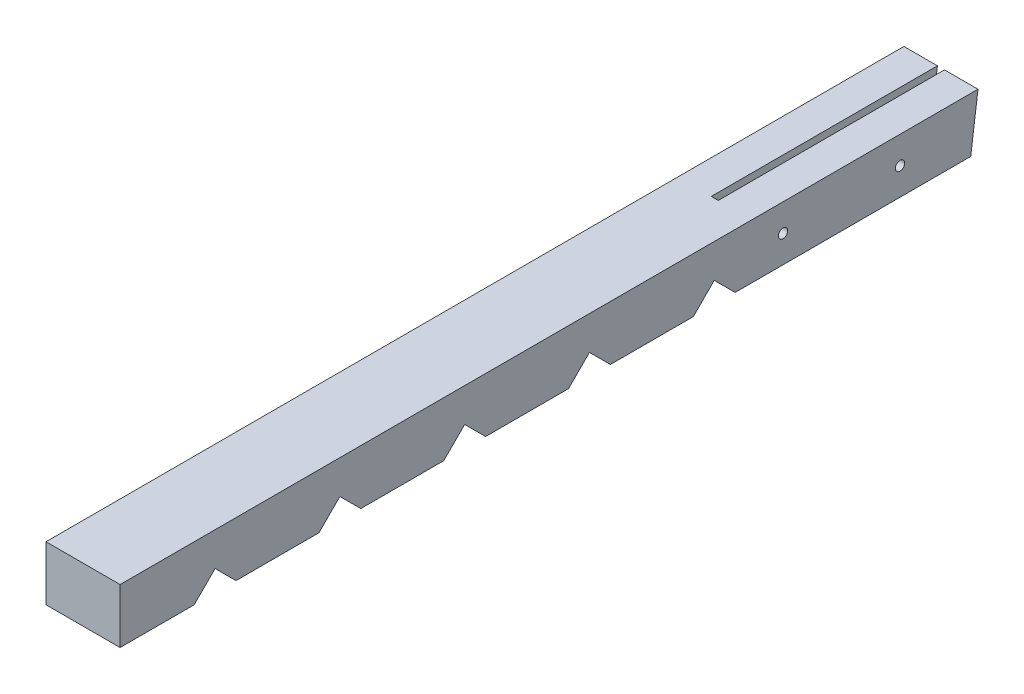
from build123d import *

# Parameters (mm, degrees)
SKETCH1_W                                  = 95
SKETCH1_H                                  = 70
EXTRUDE_H_JD_DEPTH                         = 1100
CUT_KVADRATISKT_REGELH_L_REACH             = 1105.577
CUT_KVADRATISKT_REGELH_L_DIRECTION_2_REACH = 1105.577
LPATTERN_KVADRATISKA_REGELH_L_COUNT        = 5
LPATTERN_KVADRATISKA_REGELH_L_PITCH        = 160
CUT_SKRUVH_L_F_R_STOLPF_STE_DEPTH          = 1104.576571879
CUT_SKRUVH_L_F_R_STOLPF_STE_DEPTH_BACK     = 1104.576571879
SKETCH4_R                                  = 6
SKETCH6_W                                  = 9
SKETCH6_H                                  = 150
CUT_SLITS_DEPTH                            = 290
CUT_NEDRE_STOLP_NDE_REACH                  = 1105.577
CUT_NEDRE_STOLP_NDE_DIRECTION_2_REACH      = 1105.577


with BuildPart() as part:
    # Sketch1 → Extrude h_jd (new body)
    with BuildSketch(Plane.XY):
        with Locations((0, 40)):
            Rectangle(SKETCH1_W, SKETCH1_H)
    extrude(amount=EXTRUDE_H_JD_DEPTH)

    # Sketch2 → Cut kvadratiskt regelh_l (cut, up to next)
    with BuildSketch(Plane(origin=(0, 0, 0), x_dir=(0, 0, -1), z_dir=(1, 0, 0)), mode=Mode.PRIVATE) as cut_kvadratiskt_regelh_l_sk1:
        Polygon((-978.180194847, -31.819805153), (-946.360389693, 0), (-978.180194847, 31.819805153), (-1010, 0), align=None)
    cut_kvadratiskt_regelh_l_tool1 = extrude(cut_kvadratiskt_regelh_l_sk1.sketch, amount=-CUT_KVADRATISKT_REGELH_L_REACH, mode=Mode.PRIVATE) & part.part
    cut_kvadratiskt_regelh_l = cut_kvadratiskt_regelh_l_tool1.solids().sort_by_distance((0, 0, 978.180195))[0]
    add(cut_kvadratiskt_regelh_l, mode=Mode.SUBTRACT)

    # Sketch2 → Cut kvadratiskt regelh_l direction 2 (cut, up to next)
    with BuildSketch(Plane(origin=(0, 0, 0), x_dir=(0, 0, -1), z_dir=(1, 0, 0)), mode=Mode.PRIVATE) as cut_kvadratiskt_regelh_l_direction_2_sk1:
        Polygon((-978.180194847, -31.819805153), (-946.360389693, 0), (-978.180194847, 31.819805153), (-1010, 0), align=None)
    cut_kvadratiskt_regelh_l_direction_2_tool1 = extrude(cut_kvadratiskt_regelh_l_direction_2_sk1.sketch, amount=CUT_KVADRATISKT_REGELH_L_DIRECTION_2_REACH, mode=Mode.PRIVATE) & part.part
    cut_kvadratiskt_regelh_l_direction_2 = cut_kvadratiskt_regelh_l_direction_2_tool1.solids().sort_by_distance((0, 0, 978.180195))[0]
    add(cut_kvadratiskt_regelh_l_direction_2, mode=Mode.SUBTRACT)

    # LPattern kvadratiska regelh_l: Cut kvadratiskt regelh_l, Cut kvadratiskt regelh_l direction 2 ×5
    with Locations(*[(0, 0, -i * LPATTERN_KVADRATISKA_REGELH_L_PITCH) for i in range(1, LPATTERN_KVADRATISKA_REGELH_L_COUNT)]):
        add(cut_kvadratiskt_regelh_l, mode=Mode.SUBTRACT)
        add(cut_kvadratiskt_regelh_l_direction_2, mode=Mode.SUBTRACT)

    # Sketch4 → Cut skruvh_l f_r stolpf_ste (cut, two sides: drawn at the far end of the back side and taken through both)
    with BuildSketch(Plane(origin=(0, 0, 0), x_dir=(0, -1, 0), z_dir=(1, 0, 0)).offset(-CUT_SKRUVH_L_F_R_STOLPF_STE_DEPTH_BACK)):
        with Locations((40, -100)):
            Circle(SKETCH4_R)
        with Locations((40, -250)):
            Circle(SKETCH4_R)
        with Locations(Location((-40, -250, 0), (0, 0, 270))):
            Circle(SKETCH4_R)
        with Locations(Location((-40, -100, 0), (0, 0, 270))):
            Circle(SKETCH4_R)
    extrude(amount=CUT_SKRUVH_L_F_R_STOLPF_STE_DEPTH + CUT_SKRUVH_L_F_R_STOLPF_STE_DEPTH_BACK, mode=Mode.SUBTRACT)

    # Sketch6 → Cut slits (cut)
    with BuildSketch(Plane.XY):
        Rectangle(SKETCH6_W, SKETCH6_H)
    extrude(amount=CUT_SLITS_DEPTH, mode=Mode.SUBTRACT)

    # Sketch5 → Cut nedre stolp_nde (cut, up to next)
    with BuildSketch(Plane.ZY, mode=Mode.PRIVATE) as cut_nedre_stolp_nde_sk1:
        Polygon((-294.772718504, 2285.795388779), (0, 75), (10, 0), (0, -75), (-294.772718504, -2285.795388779), (-4755.493380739, -2285.795388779), (-4755.493380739, 2285.795388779), align=None)
    cut_nedre_stolp_nde_tool1 = extrude(cut_nedre_stolp_nde_sk1.sketch, amount=-CUT_NEDRE_STOLP_NDE_REACH, mode=Mode.PRIVATE) & part.part
    add(cut_nedre_stolp_nde_tool1.solids().sort_by_distance((0, 0, -2448.100898))[0], mode=Mode.SUBTRACT)

    # Sketch5 → Cut nedre stolp_nde direction 2 (cut, up to next)
    with BuildSketch(Plane.ZY, mode=Mode.PRIVATE) as cut_nedre_stolp_nde_direction_2_sk1:
        Polygon((-294.772718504, 2285.795388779), (0, 75), (10, 0), (0, -75), (-294.772718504, -2285.795388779), (-4755.493380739, -2285.795388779), (-4755.493380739, 2285.795388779), align=None)
    cut_nedre_stolp_nde_direction_2_tool1 = extrude(cut_nedre_stolp_nde_direction_2_sk1.sketch, amount=CUT_NEDRE_STOLP_NDE_DIRECTION_2_REACH, mode=Mode.PRIVATE) & part.part
    add(cut_nedre_stolp_nde_direction_2_tool1.solids().sort_by_distance((0, 0, -2448.100898))[0], mode=Mode.SUBTRACT)


solid = part.part
